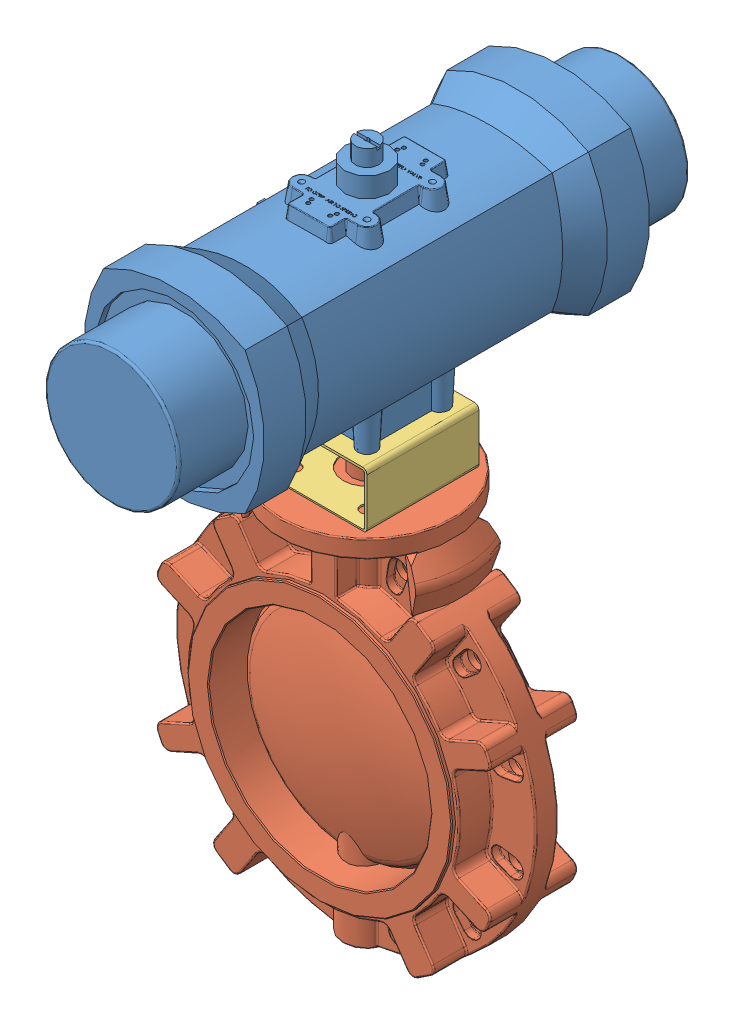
SolidWorks assembly T57BF_12IN_AS.SLDASM, configuration Default (file format 3800). Lengths in mm.
Overall size (490 930.98 693.93).
3 component instances, 3 part files, 9 mates.
Components (placement in the parent):
- G79P_AIR_SPR-1: G79P_AIR_SPR.SLDPRT [Default] at (0 520.3743 0) x (0 0 1) z (-1 0 0) size (693.93 312.93 266.81)
- T57BF_12-1: T57BF_12.SLDPRT [Default] at origin size (490 644.6 235)
- 12-BRACKET-1: 12-BRACKET.SLDPRT [Default] at (0 334.9543 -76.2) x (0 1 0) z (0 0 1) size (76.2 152.4 152.4)
Mates (geometry in assembly coordinates):
- Coincident4: coincident anti-aligned: plane of ? through (0 0 563.8083) normal (0 -1 0)
- Coincident5: coincident aligned: unknown of ?
- Coincident8: coincident aligned: unknown of T57BF_12-1
- Coincident9: coincident aligned: unknown of T57BF_12-1
- Coincident10: coincident aligned: unknown of T57BF_12-1
- Coincident12: coincident anti-aligned: plane of ? through (-49.4812 416.4883 -49.4812) normal (0 -1 0); plane of ? through (69.85 416.4883 76.2) normal (0 1 0)
- Concentric1: concentric aligned: cylinder of T57BF_12-1; circle of ?
- Parallel1: parallel aligned: plane of ? through (-45.2437 609.0521 262.001) normal (0 0 1); plane of ? through (69.85 346.6383 76.2) normal (0 0 1)
- Distance2: distance = 520.3743 mm aligned: plane of ?; plane of assembly
